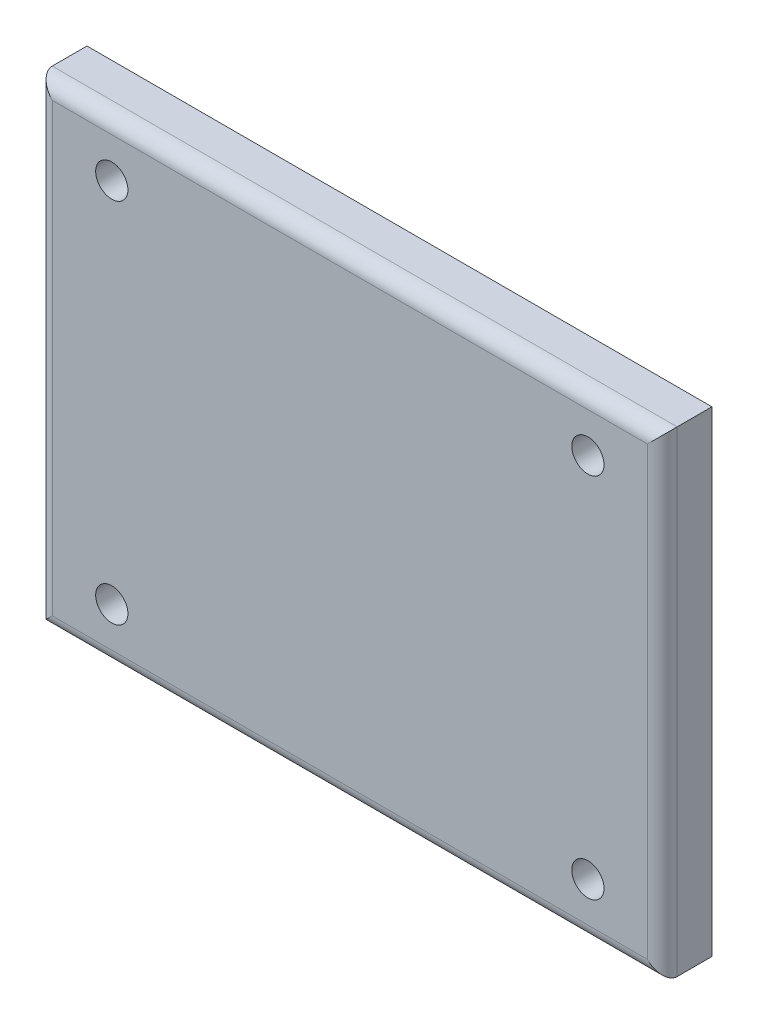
ISO-10303-21;
HEADER;
FILE_DESCRIPTION(('STEP AP214'),'2;1');
FILE_NAME('part.step','',(''),(''),'','','');
FILE_SCHEMA(('AUTOMOTIVE_DESIGN { 1 0 10303 214 1 1 1 1 }'));
ENDSEC;
DATA;
#1=APPLICATION_CONTEXT('core data for automotive mechanical design processes');
#2=APPLICATION_PROTOCOL_DEFINITION('international standard','automotive_design',2000,#1);
#3=PRODUCT_CONTEXT('',#1,'mechanical');
#4=PRODUCT('Part','Part','',(#3));
#5=PRODUCT_RELATED_PRODUCT_CATEGORY('part','',(#4));
#6=PRODUCT_DEFINITION_FORMATION('','',#4);
#7=PRODUCT_DEFINITION_CONTEXT('part definition',#1,'design');
#8=PRODUCT_DEFINITION('design','',#6,#7);
#9=PRODUCT_DEFINITION_SHAPE('','',#8);
#10=(LENGTH_UNIT() NAMED_UNIT(*) SI_UNIT(.MILLI.,.METRE.));
#11=(NAMED_UNIT(*) PLANE_ANGLE_UNIT() SI_UNIT($,.RADIAN.));
#12=(NAMED_UNIT(*) SI_UNIT($,.STERADIAN.) SOLID_ANGLE_UNIT());
#13=UNCERTAINTY_MEASURE_WITH_UNIT(LENGTH_MEASURE(1.E-05),#10,'distance_accuracy_value','');
#14=(GEOMETRIC_REPRESENTATION_CONTEXT(3) GLOBAL_UNCERTAINTY_ASSIGNED_CONTEXT((#13)) GLOBAL_UNIT_ASSIGNED_CONTEXT((#10,
#11,#12)) REPRESENTATION_CONTEXT('',''));
#15=CARTESIAN_POINT('',(0.,0.,0.));
#16=DIRECTION('',(0.,0.,1.));
#17=DIRECTION('',(1.,0.,0.));
#18=AXIS2_PLACEMENT_3D('',#15,#16,#17);
#19=CARTESIAN_POINT('',(-26.9383105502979,53.5151302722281,10.));
#20=DIRECTION('',(1.,0.,0.));
#21=DIRECTION('',(0.,1.,0.));
#22=AXIS2_PLACEMENT_3D('',#19,#20,#21);
#23=PLANE('',#22);
#24=DIRECTION('',(0.,0.,-1.));
#25=VECTOR('',#24,1.);
#26=CARTESIAN_POINT('',(-26.9383105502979,-42.4848697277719,10.));
#27=LINE('',#26,#25);
#28=CARTESIAN_POINT('',(-26.9383105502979,-42.4848697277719,7.));
#29=VERTEX_POINT('',#28);
#30=CARTESIAN_POINT('',(-26.9383105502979,-42.4848697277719,0.));
#31=VERTEX_POINT('',#30);
#32=EDGE_CURVE('E90',#29,#31,#27,.T.);
#33=ORIENTED_EDGE('',*,*,#32,.F.);
#34=DIRECTION('',(0.,-1.,0.));
#35=VECTOR('',#34,1.);
#36=CARTESIAN_POINT('',(-26.9383105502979,53.5151302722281,7.));
#37=LINE('',#36,#35);
#38=CARTESIAN_POINT('',(-26.9383105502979,53.5151302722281,7.));
#39=VERTEX_POINT('',#38);
#40=EDGE_CURVE('E53',#29,#39,#37,.F.);
#41=ORIENTED_EDGE('',*,*,#40,.T.);
#42=DIRECTION('',(0.,0.,-1.));
#43=VECTOR('',#42,1.);
#44=CARTESIAN_POINT('',(-26.9383105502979,53.5151302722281,10.));
#45=LINE('',#44,#43);
#46=CARTESIAN_POINT('',(-26.9383105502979,53.5151302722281,0.));
#47=VERTEX_POINT('',#46);
#48=EDGE_CURVE('E108',#39,#47,#45,.T.);
#49=ORIENTED_EDGE('',*,*,#48,.T.);
#50=DIRECTION('',(0.,-1.,0.));
#51=VECTOR('',#50,1.);
#52=CARTESIAN_POINT('',(-26.9383105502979,53.5151302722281,0.));
#53=LINE('',#52,#51);
#54=EDGE_CURVE('E104',#47,#31,#53,.T.);
#55=ORIENTED_EDGE('',*,*,#54,.T.);
#56=EDGE_LOOP('',(#33,#41,#49,#55));
#57=FACE_BOUND('',#56,.T.);
#58=ADVANCED_FACE('F37',(#57),#23,.F.);
#59=CARTESIAN_POINT('',(-26.9383105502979,-42.4848697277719,10.));
#60=DIRECTION('',(0.,1.,0.));
#61=DIRECTION('',(0.,0.,1.));
#62=AXIS2_PLACEMENT_3D('',#59,#60,#61);
#63=PLANE('',#62);
#64=DIRECTION('',(0.,0.,-1.));
#65=VECTOR('',#64,1.);
#66=CARTESIAN_POINT('',(99.0616894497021,-42.4848697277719,10.));
#67=LINE('',#66,#65);
#68=CARTESIAN_POINT('',(99.0616894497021,-42.4848697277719,7.));
#69=VERTEX_POINT('',#68);
#70=CARTESIAN_POINT('',(99.0616894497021,-42.4848697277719,0.));
#71=VERTEX_POINT('',#70);
#72=EDGE_CURVE('E97',#69,#71,#67,.T.);
#73=ORIENTED_EDGE('',*,*,#72,.F.);
#74=DIRECTION('',(1.,0.,0.));
#75=VECTOR('',#74,1.);
#76=CARTESIAN_POINT('',(-26.9383105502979,-42.4848697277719,7.));
#77=LINE('',#76,#75);
#78=EDGE_CURVE('E61',#69,#29,#77,.F.);
#79=ORIENTED_EDGE('',*,*,#78,.T.);
#80=ORIENTED_EDGE('',*,*,#32,.T.);
#81=DIRECTION('',(1.,0.,0.));
#82=VECTOR('',#81,1.);
#83=CARTESIAN_POINT('',(-26.9383105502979,-42.4848697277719,0.));
#84=LINE('',#83,#82);
#85=EDGE_CURVE('E93',#31,#71,#84,.T.);
#86=ORIENTED_EDGE('',*,*,#85,.T.);
#87=EDGE_LOOP('',(#73,#79,#80,#86));
#88=FACE_BOUND('',#87,.T.);
#89=ADVANCED_FACE('F92',(#88),#63,.F.);
#90=CARTESIAN_POINT('',(99.0616894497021,53.5151302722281,10.));
#91=DIRECTION('',(-1.,0.,0.));
#92=DIRECTION('',(0.,-1.,0.));
#93=AXIS2_PLACEMENT_3D('',#90,#91,#92);
#94=PLANE('',#93);
#95=DIRECTION('',(0.,0.,-1.));
#96=VECTOR('',#95,1.);
#97=CARTESIAN_POINT('',(99.0616894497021,53.5151302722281,10.));
#98=LINE('',#97,#96);
#99=CARTESIAN_POINT('',(99.0616894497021,53.5151302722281,7.));
#100=VERTEX_POINT('',#99);
#101=CARTESIAN_POINT('',(99.0616894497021,53.5151302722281,0.));
#102=VERTEX_POINT('',#101);
#103=EDGE_CURVE('E125',#100,#102,#98,.T.);
#104=ORIENTED_EDGE('',*,*,#103,.F.);
#105=DIRECTION('',(0.,1.,0.));
#106=VECTOR('',#105,1.);
#107=CARTESIAN_POINT('',(99.0616894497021,-42.4848697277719,7.));
#108=LINE('',#107,#106);
#109=EDGE_CURVE('E138',#100,#69,#108,.F.);
#110=ORIENTED_EDGE('',*,*,#109,.T.);
#111=ORIENTED_EDGE('',*,*,#72,.T.);
#112=DIRECTION('',(0.,1.,0.));
#113=VECTOR('',#112,1.);
#114=CARTESIAN_POINT('',(99.0616894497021,53.5151302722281,0.));
#115=LINE('',#114,#113);
#116=EDGE_CURVE('E106',#71,#102,#115,.T.);
#117=ORIENTED_EDGE('',*,*,#116,.T.);
#118=EDGE_LOOP('',(#104,#110,#111,#117));
#119=FACE_BOUND('',#118,.T.);
#120=ADVANCED_FACE('F171',(#119),#94,.F.);
#121=CARTESIAN_POINT('',(-26.9383105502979,53.5151302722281,10.));
#122=DIRECTION('',(0.,-1.,0.));
#123=DIRECTION('',(0.,0.,-1.));
#124=AXIS2_PLACEMENT_3D('',#121,#122,#123);
#125=PLANE('',#124);
#126=ORIENTED_EDGE('',*,*,#48,.F.);
#127=DIRECTION('',(-1.,0.,0.));
#128=VECTOR('',#127,1.);
#129=CARTESIAN_POINT('',(99.0616894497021,53.5151302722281,7.));
#130=LINE('',#129,#128);
#131=EDGE_CURVE('E143',#39,#100,#130,.F.);
#132=ORIENTED_EDGE('',*,*,#131,.T.);
#133=ORIENTED_EDGE('',*,*,#103,.T.);
#134=DIRECTION('',(-1.,0.,0.));
#135=VECTOR('',#134,1.);
#136=CARTESIAN_POINT('',(-26.9383105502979,53.5151302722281,0.));
#137=LINE('',#136,#135);
#138=EDGE_CURVE('E122',#102,#47,#137,.T.);
#139=ORIENTED_EDGE('',*,*,#138,.T.);
#140=EDGE_LOOP('',(#126,#132,#133,#139));
#141=FACE_BOUND('',#140,.T.);
#142=ADVANCED_FACE('F162',(#141),#125,.F.);
#143=CARTESIAN_POINT('',(-26.9383105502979,-42.4848697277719,10.));
#144=DIRECTION('',(0.,0.,1.));
#145=DIRECTION('',(1.,0.,0.));
#146=AXIS2_PLACEMENT_3D('',#143,#144,#145);
#147=PLANE('',#146);
#148=CARTESIAN_POINT('',(84.0616894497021,42.5151302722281,10.));
#149=DIRECTION('',(0.,0.,1.));
#150=DIRECTION('',(1.,0.,0.));
#151=AXIS2_PLACEMENT_3D('',#148,#149,#150);
#152=CIRCLE('',#151,3.25);
#153=CARTESIAN_POINT('',(87.3116894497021,42.5151302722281,10.));
#154=VERTEX_POINT('',#153);
#155=EDGE_CURVE('E245',#154,#154,#152,.T.);
#156=ORIENTED_EDGE('',*,*,#155,.F.);
#157=EDGE_LOOP('',(#156));
#158=FACE_BOUND('',#157,.T.);
#159=CARTESIAN_POINT('',(-11.9383105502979,42.5151302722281,10.));
#160=DIRECTION('',(0.,0.,1.));
#161=DIRECTION('',(1.,0.,0.));
#162=AXIS2_PLACEMENT_3D('',#159,#160,#161);
#163=CIRCLE('',#162,3.25);
#164=CARTESIAN_POINT('',(-8.68831055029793,42.5151302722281,10.));
#165=VERTEX_POINT('',#164);
#166=EDGE_CURVE('E242',#165,#165,#163,.T.);
#167=ORIENTED_EDGE('',*,*,#166,.F.);
#168=EDGE_LOOP('',(#167));
#169=FACE_BOUND('',#168,.T.);
#170=DIRECTION('',(1.,0.,0.));
#171=VECTOR('',#170,1.);
#172=CARTESIAN_POINT('',(99.0616894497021,-39.4848697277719,10.));
#173=LINE('',#172,#171);
#174=CARTESIAN_POINT('',(-23.9383105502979,-39.4848697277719,10.));
#175=VERTEX_POINT('',#174);
#176=CARTESIAN_POINT('',(96.0616894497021,-39.4848697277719,10.));
#177=VERTEX_POINT('',#176);
#178=EDGE_CURVE('E132',#175,#177,#173,.T.);
#179=ORIENTED_EDGE('',*,*,#178,.T.);
#180=DIRECTION('',(0.,1.,0.));
#181=VECTOR('',#180,1.);
#182=CARTESIAN_POINT('',(96.0616894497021,53.5151302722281,10.));
#183=LINE('',#182,#181);
#184=CARTESIAN_POINT('',(96.0616894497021,50.5151302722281,10.));
#185=VERTEX_POINT('',#184);
#186=EDGE_CURVE('E135',#177,#185,#183,.T.);
#187=ORIENTED_EDGE('',*,*,#186,.T.);
#188=DIRECTION('',(-1.,0.,0.));
#189=VECTOR('',#188,1.);
#190=CARTESIAN_POINT('',(-26.9383105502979,50.5151302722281,10.));
#191=LINE('',#190,#189);
#192=CARTESIAN_POINT('',(-23.9383105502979,50.5151302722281,10.));
#193=VERTEX_POINT('',#192);
#194=EDGE_CURVE('E96',#185,#193,#191,.T.);
#195=ORIENTED_EDGE('',*,*,#194,.T.);
#196=DIRECTION('',(0.,-1.,0.));
#197=VECTOR('',#196,1.);
#198=CARTESIAN_POINT('',(-23.9383105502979,-42.4848697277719,10.));
#199=LINE('',#198,#197);
#200=EDGE_CURVE('E129',#193,#175,#199,.T.);
#201=ORIENTED_EDGE('',*,*,#200,.T.);
#202=EDGE_LOOP('',(#179,#187,#195,#201));
#203=FACE_BOUND('',#202,.T.);
#204=CARTESIAN_POINT('',(-11.9383105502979,-31.4848697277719,10.));
#205=DIRECTION('',(0.,0.,1.));
#206=DIRECTION('',(1.,0.,0.));
#207=AXIS2_PLACEMENT_3D('',#204,#205,#206);
#208=CIRCLE('',#207,3.25);
#209=CARTESIAN_POINT('',(-8.68831055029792,-31.4848697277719,10.));
#210=VERTEX_POINT('',#209);
#211=EDGE_CURVE('E148',#210,#210,#208,.T.);
#212=ORIENTED_EDGE('',*,*,#211,.F.);
#213=EDGE_LOOP('',(#212));
#214=FACE_BOUND('',#213,.T.);
#215=CARTESIAN_POINT('',(84.0616894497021,-31.4848697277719,10.));
#216=DIRECTION('',(0.,0.,1.));
#217=DIRECTION('',(1.,0.,0.));
#218=AXIS2_PLACEMENT_3D('',#215,#216,#217);
#219=CIRCLE('',#218,3.25);
#220=CARTESIAN_POINT('',(87.3116894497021,-31.4848697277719,10.));
#221=VERTEX_POINT('',#220);
#222=EDGE_CURVE('E11',#221,#221,#219,.T.);
#223=ORIENTED_EDGE('',*,*,#222,.F.);
#224=EDGE_LOOP('',(#223));
#225=FACE_BOUND('',#224,.T.);
#226=ADVANCED_FACE('F160',(#158,#169,#203,#214,#225),#147,.T.);
#227=CARTESIAN_POINT('',(-26.9383105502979,-42.4848697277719,0.));
#228=DIRECTION('',(0.,0.,1.));
#229=DIRECTION('',(1.,0.,0.));
#230=AXIS2_PLACEMENT_3D('',#227,#228,#229);
#231=PLANE('',#230);
#232=CARTESIAN_POINT('',(84.0616894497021,42.5151302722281,0.));
#233=DIRECTION('',(0.,0.,1.));
#234=DIRECTION('',(1.,0.,0.));
#235=AXIS2_PLACEMENT_3D('',#232,#233,#234);
#236=CIRCLE('',#235,3.25);
#237=CARTESIAN_POINT('',(87.3116894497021,42.5151302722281,0.));
#238=VERTEX_POINT('',#237);
#239=EDGE_CURVE('E249',#238,#238,#236,.T.);
#240=ORIENTED_EDGE('',*,*,#239,.T.);
#241=EDGE_LOOP('',(#240));
#242=FACE_BOUND('',#241,.T.);
#243=CARTESIAN_POINT('',(-11.9383105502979,42.5151302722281,0.));
#244=DIRECTION('',(0.,0.,1.));
#245=DIRECTION('',(1.,0.,0.));
#246=AXIS2_PLACEMENT_3D('',#243,#244,#245);
#247=CIRCLE('',#246,3.25);
#248=CARTESIAN_POINT('',(-8.68831055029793,42.5151302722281,0.));
#249=VERTEX_POINT('',#248);
#250=EDGE_CURVE('E237',#249,#249,#247,.T.);
#251=ORIENTED_EDGE('',*,*,#250,.T.);
#252=EDGE_LOOP('',(#251));
#253=FACE_BOUND('',#252,.T.);
#254=ORIENTED_EDGE('',*,*,#54,.F.);
#255=ORIENTED_EDGE('',*,*,#138,.F.);
#256=ORIENTED_EDGE('',*,*,#116,.F.);
#257=ORIENTED_EDGE('',*,*,#85,.F.);
#258=EDGE_LOOP('',(#254,#255,#256,#257));
#259=FACE_BOUND('',#258,.T.);
#260=CARTESIAN_POINT('',(-11.9383105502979,-31.4848697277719,0.));
#261=DIRECTION('',(0.,0.,1.));
#262=DIRECTION('',(1.,0.,0.));
#263=AXIS2_PLACEMENT_3D('',#260,#261,#262);
#264=CIRCLE('',#263,3.25);
#265=CARTESIAN_POINT('',(-8.68831055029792,-31.4848697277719,0.));
#266=VERTEX_POINT('',#265);
#267=EDGE_CURVE('E145',#266,#266,#264,.T.);
#268=ORIENTED_EDGE('',*,*,#267,.T.);
#269=EDGE_LOOP('',(#268));
#270=FACE_BOUND('',#269,.T.);
#271=CARTESIAN_POINT('',(84.0616894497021,-31.4848697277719,0.));
#272=DIRECTION('',(0.,0.,1.));
#273=DIRECTION('',(1.,0.,0.));
#274=AXIS2_PLACEMENT_3D('',#271,#272,#273);
#275=CIRCLE('',#274,3.25);
#276=CARTESIAN_POINT('',(87.3116894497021,-31.4848697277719,0.));
#277=VERTEX_POINT('',#276);
#278=EDGE_CURVE('E46',#277,#277,#275,.T.);
#279=ORIENTED_EDGE('',*,*,#278,.T.);
#280=EDGE_LOOP('',(#279));
#281=FACE_BOUND('',#280,.T.);
#282=ADVANCED_FACE('F101',(#242,#253,#259,#270,#281),#231,.F.);
#283=CARTESIAN_POINT('',(-23.9383105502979,-42.4848697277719,7.));
#284=DIRECTION('',(0.,1.,0.));
#285=DIRECTION('',(-1.,0.,0.));
#286=AXIS2_PLACEMENT_3D('',#283,#284,#285);
#287=CYLINDRICAL_SURFACE('',#286,3.);
#288=CARTESIAN_POINT('',(-23.9383105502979,50.5151302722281,7.));
#289=DIRECTION('',(0.707106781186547,0.707106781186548,0.));
#290=DIRECTION('',(0.707106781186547,-0.707106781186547,0.));
#291=AXIS2_PLACEMENT_3D('',#288,#289,#290);
#292=ELLIPSE('',#291,4.24264068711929,3.);
#293=EDGE_CURVE('E117',#39,#193,#292,.T.);
#294=ORIENTED_EDGE('',*,*,#293,.F.);
#295=ORIENTED_EDGE('',*,*,#40,.F.);
#296=CARTESIAN_POINT('',(-23.9383105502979,-39.4848697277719,7.));
#297=DIRECTION('',(-0.707106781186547,0.707106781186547,0.));
#298=DIRECTION('',(0.707106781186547,0.707106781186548,0.));
#299=AXIS2_PLACEMENT_3D('',#296,#297,#298);
#300=ELLIPSE('',#299,4.24264068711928,3.);
#301=EDGE_CURVE('E111',#175,#29,#300,.F.);
#302=ORIENTED_EDGE('',*,*,#301,.F.);
#303=ORIENTED_EDGE('',*,*,#200,.F.);
#304=EDGE_LOOP('',(#294,#295,#302,#303));
#305=FACE_BOUND('',#304,.T.);
#306=ADVANCED_FACE('F168',(#305),#287,.T.);
#307=CARTESIAN_POINT('',(-26.9383105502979,-39.4848697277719,7.));
#308=DIRECTION('',(-1.,0.,0.));
#309=DIRECTION('',(0.,0.,1.));
#310=AXIS2_PLACEMENT_3D('',#307,#308,#309);
#311=CYLINDRICAL_SURFACE('',#310,3.);
#312=ORIENTED_EDGE('',*,*,#301,.T.);
#313=ORIENTED_EDGE('',*,*,#78,.F.);
#314=CARTESIAN_POINT('',(96.0616894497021,-39.4848697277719,7.));
#315=DIRECTION('',(-0.707106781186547,-0.707106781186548,0.));
#316=DIRECTION('',(-0.707106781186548,0.707106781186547,0.));
#317=AXIS2_PLACEMENT_3D('',#314,#315,#316);
#318=ELLIPSE('',#317,4.24264068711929,3.);
#319=EDGE_CURVE('E226',#177,#69,#318,.F.);
#320=ORIENTED_EDGE('',*,*,#319,.F.);
#321=ORIENTED_EDGE('',*,*,#178,.F.);
#322=EDGE_LOOP('',(#312,#313,#320,#321));
#323=FACE_BOUND('',#322,.T.);
#324=ADVANCED_FACE('F211',(#323),#311,.T.);
#325=CARTESIAN_POINT('',(-26.9383105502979,50.5151302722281,7.));
#326=DIRECTION('',(1.,0.,0.));
#327=DIRECTION('',(0.,0.,-1.));
#328=AXIS2_PLACEMENT_3D('',#325,#326,#327);
#329=CYLINDRICAL_SURFACE('',#328,3.);
#330=ORIENTED_EDGE('',*,*,#293,.T.);
#331=ORIENTED_EDGE('',*,*,#194,.F.);
#332=CARTESIAN_POINT('',(96.0616894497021,50.5151302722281,7.));
#333=DIRECTION('',(0.707106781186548,-0.707106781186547,0.));
#334=DIRECTION('',(0.707106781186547,0.707106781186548,0.));
#335=AXIS2_PLACEMENT_3D('',#332,#333,#334);
#336=ELLIPSE('',#335,4.24264068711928,3.);
#337=EDGE_CURVE('E228',#100,#185,#336,.T.);
#338=ORIENTED_EDGE('',*,*,#337,.F.);
#339=ORIENTED_EDGE('',*,*,#131,.F.);
#340=EDGE_LOOP('',(#330,#331,#338,#339));
#341=FACE_BOUND('',#340,.T.);
#342=ADVANCED_FACE('F207',(#341),#329,.T.);
#343=CARTESIAN_POINT('',(96.0616894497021,-42.4848697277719,7.));
#344=DIRECTION('',(0.,-1.,0.));
#345=DIRECTION('',(1.,0.,0.));
#346=AXIS2_PLACEMENT_3D('',#343,#344,#345);
#347=CYLINDRICAL_SURFACE('',#346,3.);
#348=ORIENTED_EDGE('',*,*,#319,.T.);
#349=ORIENTED_EDGE('',*,*,#109,.F.);
#350=ORIENTED_EDGE('',*,*,#337,.T.);
#351=ORIENTED_EDGE('',*,*,#186,.F.);
#352=EDGE_LOOP('',(#348,#349,#350,#351));
#353=FACE_BOUND('',#352,.T.);
#354=ADVANCED_FACE('F199',(#353),#347,.T.);
#355=CARTESIAN_POINT('',(-11.9383105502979,42.5151302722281,0.));
#356=DIRECTION('',(0.,0.,1.));
#357=DIRECTION('',(1.,0.,0.));
#358=AXIS2_PLACEMENT_3D('',#355,#356,#357);
#359=CYLINDRICAL_SURFACE('',#358,3.25);
#360=ORIENTED_EDGE('',*,*,#250,.F.);
#361=EDGE_LOOP('',(#360));
#362=FACE_BOUND('',#361,.T.);
#363=ORIENTED_EDGE('',*,*,#166,.T.);
#364=EDGE_LOOP('',(#363));
#365=FACE_BOUND('',#364,.T.);
#366=ADVANCED_FACE('F189',(#362,#365),#359,.F.);
#367=CARTESIAN_POINT('',(84.0616894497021,42.5151302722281,0.));
#368=DIRECTION('',(0.,0.,1.));
#369=DIRECTION('',(1.,0.,0.));
#370=AXIS2_PLACEMENT_3D('',#367,#368,#369);
#371=CYLINDRICAL_SURFACE('',#370,3.25);
#372=ORIENTED_EDGE('',*,*,#239,.F.);
#373=EDGE_LOOP('',(#372));
#374=FACE_BOUND('',#373,.T.);
#375=ORIENTED_EDGE('',*,*,#155,.T.);
#376=EDGE_LOOP('',(#375));
#377=FACE_BOUND('',#376,.T.);
#378=ADVANCED_FACE('F184',(#374,#377),#371,.F.);
#379=CARTESIAN_POINT('',(-11.9383105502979,-31.4848697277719,0.));
#380=DIRECTION('',(0.,0.,1.));
#381=DIRECTION('',(1.,0.,0.));
#382=AXIS2_PLACEMENT_3D('',#379,#380,#381);
#383=CYLINDRICAL_SURFACE('',#382,3.25);
#384=ORIENTED_EDGE('',*,*,#267,.F.);
#385=EDGE_LOOP('',(#384));
#386=FACE_BOUND('',#385,.T.);
#387=ORIENTED_EDGE('',*,*,#211,.T.);
#388=EDGE_LOOP('',(#387));
#389=FACE_BOUND('',#388,.T.);
#390=ADVANCED_FACE('F157',(#386,#389),#383,.F.);
#391=CARTESIAN_POINT('',(84.0616894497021,-31.4848697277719,0.));
#392=DIRECTION('',(0.,0.,1.));
#393=DIRECTION('',(1.,0.,0.));
#394=AXIS2_PLACEMENT_3D('',#391,#392,#393);
#395=CYLINDRICAL_SURFACE('',#394,3.25);
#396=ORIENTED_EDGE('',*,*,#278,.F.);
#397=EDGE_LOOP('',(#396));
#398=FACE_BOUND('',#397,.T.);
#399=ORIENTED_EDGE('',*,*,#222,.T.);
#400=EDGE_LOOP('',(#399));
#401=FACE_BOUND('',#400,.T.);
#402=ADVANCED_FACE('F39',(#398,#401),#395,.F.);
#403=CLOSED_SHELL('',(#58,#89,#120,#142,#226,#282,#306,#324,#342,#354,#366,#378,#390,#402));
#404=MANIFOLD_SOLID_BREP('B2',#403);
#405=ADVANCED_BREP_SHAPE_REPRESENTATION('',(#18,#404),#14);
#406=SHAPE_DEFINITION_REPRESENTATION(#9,#405);
ENDSEC;
END-ISO-10303-21;
